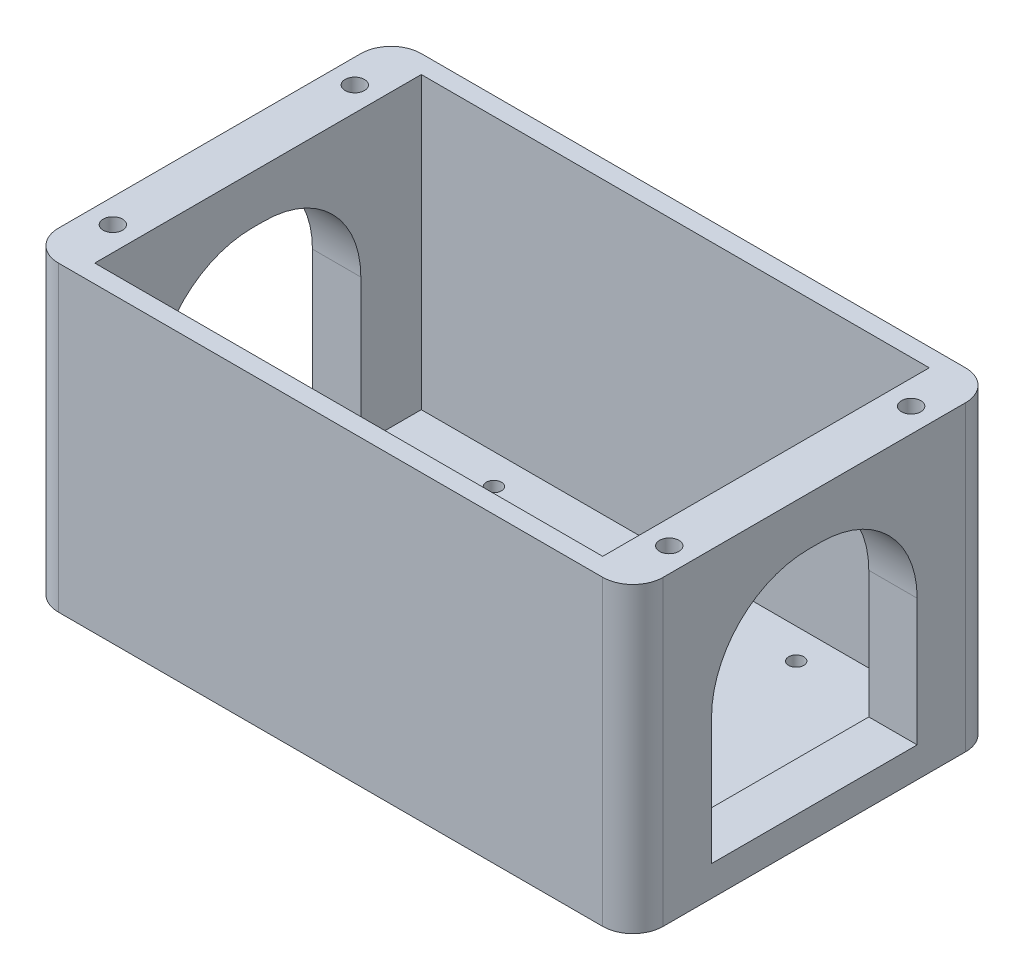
from build123d import *

# Parameters (mm, degrees)
SKETCH1_W           = 127
SKETCH1_H           = 76.2
BOSS_EXTRUDE1_DEPTH = 63.5
SKETCH2_W           = 106.68
SKETCH2_H           = 68.58
CUT_EXTRUDE2_DEPTH  = 60.96
SKETCH5_R           = 2.032
CUT_EXTRUDE4_DEPTH  = 162.144934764
FILLET1_R           = 6.35
SKETCH7_R           = 1.5875
CUT_EXTRUDE6_DEPTH  = 162.144934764
CUT_EXTRUDE7_DEPTH  = 162.144934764


with BuildPart() as part:
    # Sketch1 → Boss-Extrude1 (new body)
    with BuildSketch(Plane(origin=(0, 0, 0), x_dir=(1, 0, 0), z_dir=(0, 1, 0))):
        with Locations((63.5, 38.1)):
            Rectangle(SKETCH1_W, SKETCH1_H)
    extrude(amount=BOSS_EXTRUDE1_DEPTH)

    # Sketch2 → Cut-Extrude2 (cut)
    with BuildSketch(Plane(origin=(0, 63.5, 0), x_dir=(1, 0, 0), z_dir=(0, 1, 0))):
        with Locations((63.5, 38.1)):
            Rectangle(SKETCH2_W, SKETCH2_H)
    extrude(amount=-CUT_EXTRUDE2_DEPTH, mode=Mode.SUBTRACT)

    # Sketch5 → Cut-Extrude4 (cut, through all)
    with BuildSketch(Plane(origin=(0, 63.5, 0), x_dir=(1, 0, 0), z_dir=(0, 1, 0))):
        with Locations(Location((5.08, 63.5, 0), (0, 0, 270))):
            Circle(SKETCH5_R)
        with Locations(Location((5.08, 12.7, 0), (0, 0, 270))):
            Circle(SKETCH5_R)
        with Locations(Location((121.92, 63.5, 0), (0, 0, 270))):
            Circle(SKETCH5_R)
        with Locations(Location((121.92, 12.7, 0), (0, 0, 270))):
            Circle(SKETCH5_R)
    extrude(amount=-CUT_EXTRUDE4_DEPTH, mode=Mode.SUBTRACT)

    # Fillet1
    fillet1_edges = [part.edges().sort_by_distance(p)[0] for p in [
        (0, 31.75, -76.2),
        (127, 31.75, -76.2),
        (127, 31.75, 0),
        (0, 31.75, 0),
    ]]
    fillet(fillet1_edges, radius=FILLET1_R)

    # Sketch7 → Cut-Extrude6 (cut, through all)
    with BuildSketch(Plane.XZ):
        with Locations(Location((31.75, -66.04, 0), (0, 0, 270))):
            Circle(SKETCH7_R)
        with Locations(Location((31.75, -10.16, 0), (0, 0, 270))):
            Circle(SKETCH7_R)
        with Locations(Location((95.25, -10.16, 0), (0, 0, 270))):
            Circle(SKETCH7_R)
        with Locations(Location((95.25, -66.04, 0), (0, 0, 270))):
            Circle(SKETCH7_R)
    extrude(amount=-CUT_EXTRUDE6_DEPTH, mode=Mode.SUBTRACT)

    # Sketch8 → Cut-Extrude7 (cut, through all)
    with BuildSketch(Plane.ZY):
        with BuildLine():
            Line((-59.69, 6.35), (-16.51, 6.35))
            Line((-16.51, 6.35), (-16.51, 33.02))
            ThreePointArc((-16.51, 33.02), (-22.461590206, 47.388409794), (-36.83, 53.34))
            Line((-36.83, 53.34), (-39.37, 53.34))
            ThreePointArc((-39.37, 53.34), (-53.738409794, 47.388409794), (-59.69, 33.02))
            Line((-59.69, 33.02), (-59.69, 6.35))
        make_face()
    extrude(amount=-CUT_EXTRUDE7_DEPTH, mode=Mode.SUBTRACT)


solid = part.part
